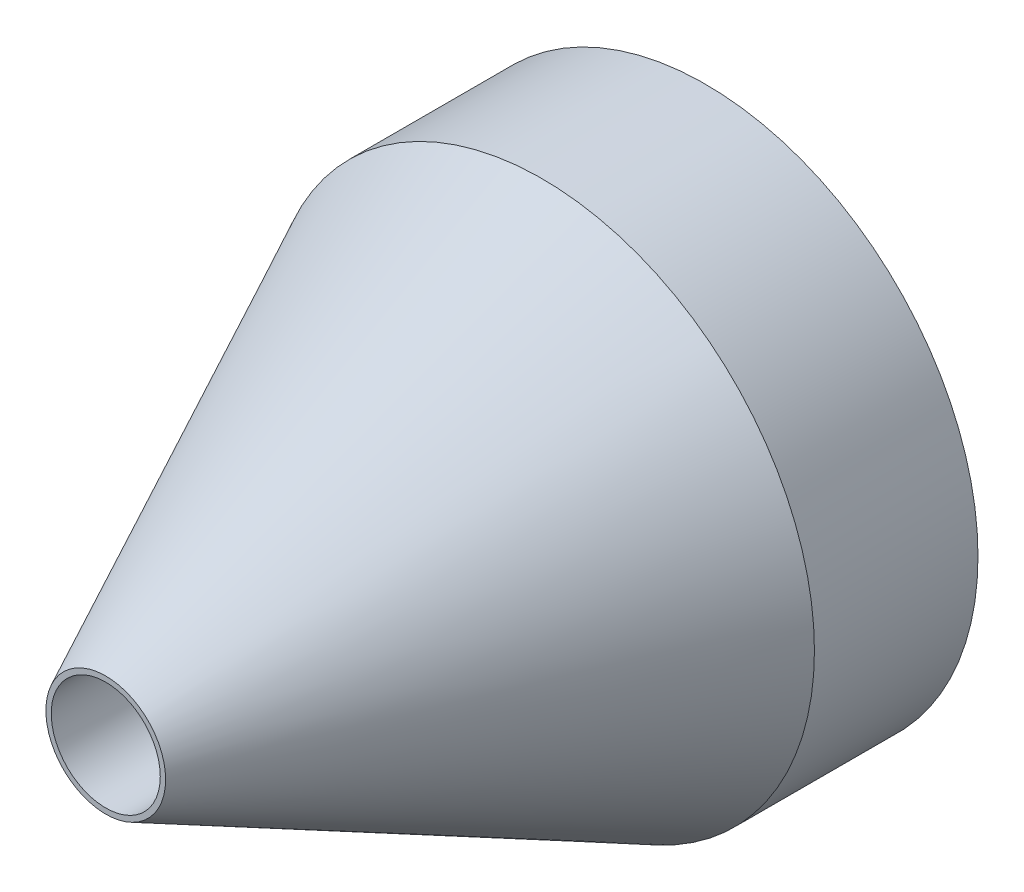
ISO-10303-21;
HEADER;
FILE_DESCRIPTION(('STEP AP214'),'2;1');
FILE_NAME('part.step','',(''),(''),'','','');
FILE_SCHEMA(('AUTOMOTIVE_DESIGN { 1 0 10303 214 1 1 1 1 }'));
ENDSEC;
DATA;
#1=APPLICATION_CONTEXT('core data for automotive mechanical design processes');
#2=APPLICATION_PROTOCOL_DEFINITION('international standard','automotive_design',2000,#1);
#3=PRODUCT_CONTEXT('',#1,'mechanical');
#4=PRODUCT('Part','Part','',(#3));
#5=PRODUCT_RELATED_PRODUCT_CATEGORY('part','',(#4));
#6=PRODUCT_DEFINITION_FORMATION('','',#4);
#7=PRODUCT_DEFINITION_CONTEXT('part definition',#1,'design');
#8=PRODUCT_DEFINITION('design','',#6,#7);
#9=PRODUCT_DEFINITION_SHAPE('','',#8);
#10=(LENGTH_UNIT() NAMED_UNIT(*) SI_UNIT(.MILLI.,.METRE.));
#11=(NAMED_UNIT(*) PLANE_ANGLE_UNIT() SI_UNIT($,.RADIAN.));
#12=(NAMED_UNIT(*) SI_UNIT($,.STERADIAN.) SOLID_ANGLE_UNIT());
#13=UNCERTAINTY_MEASURE_WITH_UNIT(LENGTH_MEASURE(1.E-05),#10,'distance_accuracy_value','');
#14=(GEOMETRIC_REPRESENTATION_CONTEXT(3) GLOBAL_UNCERTAINTY_ASSIGNED_CONTEXT((#13)) GLOBAL_UNIT_ASSIGNED_CONTEXT((#10,
#11,#12)) REPRESENTATION_CONTEXT('',''));
#15=CARTESIAN_POINT('',(0.,0.,0.));
#16=DIRECTION('',(0.,0.,1.));
#17=DIRECTION('',(1.,0.,0.));
#18=AXIS2_PLACEMENT_3D('',#15,#16,#17);
#19=CARTESIAN_POINT('',(0.,0.,15.));
#20=DIRECTION('',(0.,0.,-1.));
#21=DIRECTION('',(-1.,0.,0.));
#22=AXIS2_PLACEMENT_3D('',#19,#20,#21);
#23=CYLINDRICAL_SURFACE('',#22,25.);
#24=CARTESIAN_POINT('',(0.,0.,15.));
#25=DIRECTION('',(0.,0.,1.));
#26=DIRECTION('',(1.,0.,0.));
#27=AXIS2_PLACEMENT_3D('',#24,#25,#26);
#28=CIRCLE('',#27,25.);
#29=CARTESIAN_POINT('',(25.,0.,15.));
#30=VERTEX_POINT('',#29);
#31=EDGE_CURVE('E45',#30,#30,#28,.T.);
#32=ORIENTED_EDGE('',*,*,#31,.F.);
#33=EDGE_LOOP('',(#32));
#34=FACE_BOUND('',#33,.T.);
#35=CARTESIAN_POINT('',(0.,0.,0.));
#36=DIRECTION('',(0.,0.,1.));
#37=DIRECTION('',(1.,0.,0.));
#38=AXIS2_PLACEMENT_3D('',#35,#36,#37);
#39=CIRCLE('',#38,25.);
#40=CARTESIAN_POINT('',(25.,0.,0.));
#41=VERTEX_POINT('',#40);
#42=EDGE_CURVE('E49',#41,#41,#39,.T.);
#43=ORIENTED_EDGE('',*,*,#42,.T.);
#44=EDGE_LOOP('',(#43));
#45=FACE_BOUND('',#44,.T.);
#46=ADVANCED_FACE('F33',(#34,#45),#23,.T.);
#47=CARTESIAN_POINT('',(0.,0.,0.));
#48=DIRECTION('',(0.,0.,1.));
#49=DIRECTION('',(1.,0.,0.));
#50=AXIS2_PLACEMENT_3D('',#47,#48,#49);
#51=PLANE('',#50);
#52=CARTESIAN_POINT('',(0.,0.,0.));
#53=DIRECTION('',(0.,0.,1.));
#54=DIRECTION('',(1.,0.,0.));
#55=AXIS2_PLACEMENT_3D('',#52,#53,#54);
#56=CIRCLE('',#55,21.25);
#57=CARTESIAN_POINT('',(21.25,0.,0.));
#58=VERTEX_POINT('',#57);
#59=EDGE_CURVE('E10',#58,#58,#56,.T.);
#60=ORIENTED_EDGE('',*,*,#59,.T.);
#61=EDGE_LOOP('',(#60));
#62=FACE_BOUND('',#61,.T.);
#63=ORIENTED_EDGE('',*,*,#42,.F.);
#64=EDGE_LOOP('',(#63));
#65=FACE_BOUND('',#64,.T.);
#66=ADVANCED_FACE('F83',(#62,#65),#51,.F.);
#67=CARTESIAN_POINT('',(0.,0.,15.));
#68=DIRECTION('',(0.,0.,-1.));
#69=DIRECTION('',(1.,0.,0.));
#70=AXIS2_PLACEMENT_3D('',#67,#68,#69);
#71=CONICAL_SURFACE('',#70,25.,0.453785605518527);
#72=CARTESIAN_POINT('',(0.,0.,55.));
#73=DIRECTION('',(0.,0.,1.));
#74=DIRECTION('',(1.,0.,0.));
#75=AXIS2_PLACEMENT_3D('',#72,#73,#74);
#76=CIRCLE('',#75,5.4906964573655);
#77=CARTESIAN_POINT('',(5.4906964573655,0.,55.));
#78=VERTEX_POINT('',#77);
#79=EDGE_CURVE('E58',#78,#78,#76,.T.);
#80=CARTESIAN_POINT('',(5.4906964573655,0.,55.));
#81=CARTESIAN_POINT('',(5.69391836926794,0.,54.5833333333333));
#82=CARTESIAN_POINT('',(5.89714028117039,0.,54.1666666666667));
#83=CARTESIAN_POINT('',(6.30358410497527,0.,53.3333333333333));
#84=CARTESIAN_POINT('',(6.50680601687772,0.,52.9166666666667));
#85=CARTESIAN_POINT('',(6.9132498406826,0.,52.0833333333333));
#86=CARTESIAN_POINT('',(7.11647175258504,0.,51.6666666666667));
#87=CARTESIAN_POINT('',(7.52291557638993,0.,50.8333333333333));
#88=CARTESIAN_POINT('',(7.72613748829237,0.,50.4166666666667));
#89=CARTESIAN_POINT('',(8.13258131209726,0.,49.5833333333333));
#90=CARTESIAN_POINT('',(8.3358032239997,0.,49.1666666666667));
#91=CARTESIAN_POINT('',(8.74224704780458,0.,48.3333333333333));
#92=CARTESIAN_POINT('',(8.94546895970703,0.,47.9166666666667));
#93=CARTESIAN_POINT('',(9.35191278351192,0.,47.0833333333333));
#94=CARTESIAN_POINT('',(9.55513469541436,0.,46.6666666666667));
#95=CARTESIAN_POINT('',(9.96157851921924,0.,45.8333333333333));
#96=CARTESIAN_POINT('',(10.1648004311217,0.,45.4166666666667));
#97=CARTESIAN_POINT('',(10.5712442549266,0.,44.5833333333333));
#98=CARTESIAN_POINT('',(10.774466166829,0.,44.1666666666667));
#99=CARTESIAN_POINT('',(11.1809099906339,0.,43.3333333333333));
#100=CARTESIAN_POINT('',(11.3841319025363,0.,42.9166666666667));
#101=CARTESIAN_POINT('',(11.7905757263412,0.,42.0833333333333));
#102=CARTESIAN_POINT('',(11.9937976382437,0.,41.6666666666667));
#103=CARTESIAN_POINT('',(12.4002414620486,0.,40.8333333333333));
#104=CARTESIAN_POINT('',(12.603463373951,0.,40.4166666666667));
#105=CARTESIAN_POINT('',(13.0099071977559,0.,39.5833333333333));
#106=CARTESIAN_POINT('',(13.2131291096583,0.,39.1666666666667));
#107=CARTESIAN_POINT('',(13.6195729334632,0.,38.3333333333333));
#108=CARTESIAN_POINT('',(13.8227948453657,0.,37.9166666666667));
#109=CARTESIAN_POINT('',(14.2292386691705,0.,37.0833333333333));
#110=CARTESIAN_POINT('',(14.432460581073,0.,36.6666666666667));
#111=CARTESIAN_POINT('',(14.8389044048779,0.,35.8333333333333));
#112=CARTESIAN_POINT('',(15.0421263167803,0.,35.4166666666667));
#113=CARTESIAN_POINT('',(15.4485701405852,0.,34.5833333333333));
#114=CARTESIAN_POINT('',(15.6517920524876,0.,34.1666666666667));
#115=CARTESIAN_POINT('',(16.0582358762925,0.,33.3333333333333));
#116=CARTESIAN_POINT('',(16.261457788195,0.,32.9166666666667));
#117=CARTESIAN_POINT('',(16.6679016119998,0.,32.0833333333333));
#118=CARTESIAN_POINT('',(16.8711235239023,0.,31.6666666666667));
#119=CARTESIAN_POINT('',(17.2775673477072,0.,30.8333333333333));
#120=CARTESIAN_POINT('',(17.4807892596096,0.,30.4166666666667));
#121=CARTESIAN_POINT('',(17.8872330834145,0.,29.5833333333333));
#122=CARTESIAN_POINT('',(18.090454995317,0.,29.1666666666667));
#123=CARTESIAN_POINT('',(18.4968988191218,0.,28.3333333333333));
#124=CARTESIAN_POINT('',(18.7001207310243,0.,27.9166666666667));
#125=CARTESIAN_POINT('',(19.1065645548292,0.,27.0833333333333));
#126=CARTESIAN_POINT('',(19.3097864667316,0.,26.6666666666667));
#127=CARTESIAN_POINT('',(19.7162302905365,0.,25.8333333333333));
#128=CARTESIAN_POINT('',(19.9194522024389,0.,25.4166666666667));
#129=CARTESIAN_POINT('',(20.3258960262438,0.,24.5833333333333));
#130=CARTESIAN_POINT('',(20.5291179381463,0.,24.1666666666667));
#131=CARTESIAN_POINT('',(20.9355617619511,0.,23.3333333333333));
#132=CARTESIAN_POINT('',(21.1387836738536,0.,22.9166666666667));
#133=CARTESIAN_POINT('',(21.5452274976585,0.,22.0833333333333));
#134=CARTESIAN_POINT('',(21.7484494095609,0.,21.6666666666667));
#135=CARTESIAN_POINT('',(22.1548932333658,0.,20.8333333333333));
#136=CARTESIAN_POINT('',(22.3581151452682,0.,20.4166666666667));
#137=CARTESIAN_POINT('',(22.7645589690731,0.,19.5833333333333));
#138=CARTESIAN_POINT('',(22.9677808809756,0.,19.1666666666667));
#139=CARTESIAN_POINT('',(23.3742247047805,0.,18.3333333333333));
#140=CARTESIAN_POINT('',(23.5774466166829,0.,17.9166666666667));
#141=CARTESIAN_POINT('',(23.9838904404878,0.,17.0833333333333));
#142=CARTESIAN_POINT('',(24.1871123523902,0.,16.6666666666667));
#143=CARTESIAN_POINT('',(24.5935561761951,0.,15.8333333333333));
#144=CARTESIAN_POINT('',(24.7967780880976,0.,15.4166666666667));
#145=CARTESIAN_POINT('',(25.,0.,15.));
#146=B_SPLINE_CURVE_WITH_KNOTS('',3,(#80,#81,#82,#83,#84,#85,#86,#87,#88,#89,#90,#91,#92,#93,
#94,#95,#96,#97,#98,#99,#100,#101,#102,#103,#104,#105,#106,#107,#108,#109,#110,#111,#112,#113,
#114,#115,#116,#117,#118,#119,#120,#121,#122,#123,#124,#125,#126,#127,#128,#129,#130,#131,#132,
#133,#134,#135,#136,#137,#138,#139,#140,#141,#142,#143,#144,#145),.UNSPECIFIED.,.F.,.F.,(4,2,2,
2,2,2,2,2,2,2,2,2,2,2,2,2,2,2,2,2,2,2,2,2,2,2,2,2,2,2,2,2,4),(0.,1.39075242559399,
2.78150485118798,4.17225727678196,5.56300970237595,6.95376212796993,8.34451455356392,
9.73526697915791,11.1260194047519,12.5167718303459,13.9075242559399,15.2982766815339,
16.6890291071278,18.0797815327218,19.4705339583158,20.8612863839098,22.2520388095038,
23.6427912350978,25.0335436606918,26.4242960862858,27.8150485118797,29.2058009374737,
30.5965533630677,31.9873057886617,33.3780582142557,34.7688106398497,36.1595630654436,
37.5503154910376,38.9410679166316,40.3318203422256,41.7225727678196,43.1133251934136,
44.5040776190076),.UNSPECIFIED.);
#147=EDGE_CURVE('BSEAM77',#78,#30,#146,.T.);
#148=ORIENTED_EDGE('',*,*,#79,.F.);
#149=ORIENTED_EDGE('',*,*,#31,.T.);
#150=ORIENTED_EDGE('',*,*,#147,.T.);
#151=ORIENTED_EDGE('',*,*,#147,.F.);
#152=EDGE_LOOP('',(#148,#150,#149,#151));
#153=FACE_BOUND('',#152,.T.);
#154=ADVANCED_FACE('F77',(#153),#71,.T.);
#155=CARTESIAN_POINT('',(0.,0.,55.));
#156=DIRECTION('',(0.,0.,1.));
#157=DIRECTION('',(1.,0.,0.));
#158=AXIS2_PLACEMENT_3D('',#155,#156,#157);
#159=PLANE('',#158);
#160=CARTESIAN_POINT('',(0.,0.,55.));
#161=DIRECTION('',(0.,0.,1.));
#162=DIRECTION('',(1.,0.,0.));
#163=AXIS2_PLACEMENT_3D('',#160,#161,#162);
#164=CIRCLE('',#163,5.);
#165=CARTESIAN_POINT('',(5.,0.,55.));
#166=VERTEX_POINT('',#165);
#167=EDGE_CURVE('E56',#166,#166,#164,.T.);
#168=ORIENTED_EDGE('',*,*,#167,.F.);
#169=EDGE_LOOP('',(#168));
#170=FACE_BOUND('',#169,.T.);
#171=ORIENTED_EDGE('',*,*,#79,.T.);
#172=EDGE_LOOP('',(#171));
#173=FACE_BOUND('',#172,.T.);
#174=ADVANCED_FACE('F73',(#170,#173),#159,.T.);
#175=CARTESIAN_POINT('',(0.,0.,15.));
#176=DIRECTION('',(0.,0.,-1.));
#177=DIRECTION('',(-1.,0.,0.));
#178=AXIS2_PLACEMENT_3D('',#175,#176,#177);
#179=CYLINDRICAL_SURFACE('',#178,19.75);
#180=CARTESIAN_POINT('',(0.,0.,1.49999999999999));
#181=DIRECTION('',(0.,0.,1.));
#182=DIRECTION('',(1.,0.,0.));
#183=AXIS2_PLACEMENT_3D('',#180,#181,#182);
#184=CIRCLE('',#183,19.75);
#185=CARTESIAN_POINT('',(19.75,0.,1.49999999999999));
#186=VERTEX_POINT('',#185);
#187=EDGE_CURVE('E41',#186,#186,#184,.F.);
#188=ORIENTED_EDGE('',*,*,#187,.T.);
#189=EDGE_LOOP('',(#188));
#190=FACE_BOUND('',#189,.T.);
#191=CARTESIAN_POINT('',(0.,0.,15.));
#192=DIRECTION('',(0.,0.,-1.));
#193=DIRECTION('',(-1.,0.,0.));
#194=AXIS2_PLACEMENT_3D('',#191,#192,#193);
#195=CIRCLE('',#194,19.75);
#196=CARTESIAN_POINT('',(-19.75,0.,15.));
#197=VERTEX_POINT('',#196);
#198=EDGE_CURVE('E62',#197,#197,#195,.F.);
#199=ORIENTED_EDGE('',*,*,#198,.T.);
#200=EDGE_LOOP('',(#199));
#201=FACE_BOUND('',#200,.T.);
#202=ADVANCED_FACE('F76',(#190,#201),#179,.F.);
#203=CARTESIAN_POINT('',(0.,0.,15.));
#204=DIRECTION('',(0.,0.,-1.));
#205=DIRECTION('',(-1.,0.,0.));
#206=AXIS2_PLACEMENT_3D('',#203,#204,#205);
#207=PLANE('',#206);
#208=CARTESIAN_POINT('',(0.,0.,15.));
#209=DIRECTION('',(0.,0.,-1.));
#210=DIRECTION('',(-1.,0.,0.));
#211=AXIS2_PLACEMENT_3D('',#208,#209,#210);
#212=CIRCLE('',#211,20.15);
#213=CARTESIAN_POINT('',(-20.15,0.,15.));
#214=VERTEX_POINT('',#213);
#215=EDGE_CURVE('E55',#214,#214,#212,.T.);
#216=ORIENTED_EDGE('',*,*,#215,.F.);
#217=EDGE_LOOP('',(#216));
#218=FACE_BOUND('',#217,.T.);
#219=ORIENTED_EDGE('',*,*,#198,.F.);
#220=EDGE_LOOP('',(#219));
#221=FACE_BOUND('',#220,.T.);
#222=ADVANCED_FACE('F98',(#218,#221),#207,.F.);
#223=CARTESIAN_POINT('',(0.,0.,15.));
#224=DIRECTION('',(0.,0.,-1.));
#225=DIRECTION('',(-1.,0.,0.));
#226=AXIS2_PLACEMENT_3D('',#223,#224,#225);
#227=CONICAL_SURFACE('',#226,20.15,0.436332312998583);
#228=CARTESIAN_POINT('',(0.,0.,47.4892798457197));
#229=DIRECTION('',(0.,0.,-1.));
#230=DIRECTION('',(-1.,0.,0.));
#231=AXIS2_PLACEMENT_3D('',#228,#229,#230);
#232=CIRCLE('',#231,5.);
#233=CARTESIAN_POINT('',(-5.,0.,47.4892798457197));
#234=VERTEX_POINT('',#233);
#235=EDGE_CURVE('E52',#234,#234,#232,.F.);
#236=CARTESIAN_POINT('',(-5.,0.,47.4892798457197));
#237=CARTESIAN_POINT('',(-5.15781249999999,0.,47.1508498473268));
#238=CARTESIAN_POINT('',(-5.31562499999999,0.,46.8124198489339));
#239=CARTESIAN_POINT('',(-5.63125,0.,46.1355598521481));
#240=CARTESIAN_POINT('',(-5.7890625,0.,45.7971298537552));
#241=CARTESIAN_POINT('',(-6.1046875,0.,45.1202698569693));
#242=CARTESIAN_POINT('',(-6.2625,0.,44.7818398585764));
#243=CARTESIAN_POINT('',(-6.57812499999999,0.,44.1049798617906));
#244=CARTESIAN_POINT('',(-6.7359375,0.,43.7665498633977));
#245=CARTESIAN_POINT('',(-7.0515625,0.,43.0896898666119));
#246=CARTESIAN_POINT('',(-7.209375,0.,42.7512598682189));
#247=CARTESIAN_POINT('',(-7.525,0.,42.0743998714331));
#248=CARTESIAN_POINT('',(-7.6828125,0.,41.7359698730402));
#249=CARTESIAN_POINT('',(-7.9984375,0.,41.0591098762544));
#250=CARTESIAN_POINT('',(-8.15624999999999,0.,40.7206798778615));
#251=CARTESIAN_POINT('',(-8.471875,0.,40.0438198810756));
#252=CARTESIAN_POINT('',(-8.6296875,0.,39.7053898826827));
#253=CARTESIAN_POINT('',(-8.9453125,0.,39.0285298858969));
#254=CARTESIAN_POINT('',(-9.103125,0.,38.690099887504));
#255=CARTESIAN_POINT('',(-9.41875,0.,38.0132398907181));
#256=CARTESIAN_POINT('',(-9.5765625,0.,37.6748098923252));
#257=CARTESIAN_POINT('',(-9.8921875,0.,36.9979498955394));
#258=CARTESIAN_POINT('',(-10.05,0.,36.6595198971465));
#259=CARTESIAN_POINT('',(-10.365625,0.,35.9826599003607));
#260=CARTESIAN_POINT('',(-10.5234375,0.,35.6442299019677));
#261=CARTESIAN_POINT('',(-10.8390625,0.,34.9673699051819));
#262=CARTESIAN_POINT('',(-10.996875,0.,34.628939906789));
#263=CARTESIAN_POINT('',(-11.3125,0.,33.9520799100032));
#264=CARTESIAN_POINT('',(-11.4703125,0.,33.6136499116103));
#265=CARTESIAN_POINT('',(-11.7859375,0.,32.9367899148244));
#266=CARTESIAN_POINT('',(-11.94375,0.,32.5983599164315));
#267=CARTESIAN_POINT('',(-12.259375,0.,31.9214999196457));
#268=CARTESIAN_POINT('',(-12.4171875,0.,31.5830699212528));
#269=CARTESIAN_POINT('',(-12.7328125,0.,30.906209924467));
#270=CARTESIAN_POINT('',(-12.890625,0.,30.567779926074));
#271=CARTESIAN_POINT('',(-13.20625,0.,29.8909199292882));
#272=CARTESIAN_POINT('',(-13.3640625,0.,29.5524899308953));
#273=CARTESIAN_POINT('',(-13.6796875,0.,28.8756299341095));
#274=CARTESIAN_POINT('',(-13.8375,0.,28.5371999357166));
#275=CARTESIAN_POINT('',(-14.153125,0.,27.8603399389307));
#276=CARTESIAN_POINT('',(-14.3109375,0.,27.5219099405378));
#277=CARTESIAN_POINT('',(-14.6265625,0.,26.845049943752));
#278=CARTESIAN_POINT('',(-14.784375,0.,26.5066199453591));
#279=CARTESIAN_POINT('',(-15.1,0.,25.8297599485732));
#280=CARTESIAN_POINT('',(-15.2578125,0.,25.4913299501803));
#281=CARTESIAN_POINT('',(-15.5734375,0.,24.8144699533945));
#282=CARTESIAN_POINT('',(-15.73125,0.,24.4760399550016));
#283=CARTESIAN_POINT('',(-16.046875,0.,23.7991799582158));
#284=CARTESIAN_POINT('',(-16.2046875,0.,23.4607499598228));
#285=CARTESIAN_POINT('',(-16.5203125,0.,22.783889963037));
#286=CARTESIAN_POINT('',(-16.678125,0.,22.4454599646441));
#287=CARTESIAN_POINT('',(-16.99375,0.,21.7685999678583));
#288=CARTESIAN_POINT('',(-17.1515625,0.,21.4301699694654));
#289=CARTESIAN_POINT('',(-17.4671875,0.,20.7533099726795));
#290=CARTESIAN_POINT('',(-17.625,0.,20.4148799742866));
#291=CARTESIAN_POINT('',(-17.940625,0.,19.7380199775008));
#292=CARTESIAN_POINT('',(-18.0984375,0.,19.3995899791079));
#293=CARTESIAN_POINT('',(-18.4140625,0.,18.7227299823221));
#294=CARTESIAN_POINT('',(-18.571875,0.,18.3842999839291));
#295=CARTESIAN_POINT('',(-18.8875,0.,17.7074399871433));
#296=CARTESIAN_POINT('',(-19.0453125,0.,17.3690099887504));
#297=CARTESIAN_POINT('',(-19.3609375,0.,16.6921499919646));
#298=CARTESIAN_POINT('',(-19.51875,0.,16.3537199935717));
#299=CARTESIAN_POINT('',(-19.834375,0.,15.6768599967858));
#300=CARTESIAN_POINT('',(-19.9921875,0.,15.3384299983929));
#301=CARTESIAN_POINT('',(-20.15,0.,15.));
#302=B_SPLINE_CURVE_WITH_KNOTS('',3,(#236,#237,#238,#239,#240,#241,#242,#243,#244,#245,#246,
#247,#248,#249,#250,#251,#252,#253,#254,#255,#256,#257,#258,#259,#260,#261,#262,#263,#264,#265,
#266,#267,#268,#269,#270,#271,#272,#273,#274,#275,#276,#277,#278,#279,#280,#281,#282,#283,#284,
#285,#286,#287,#288,#289,#290,#291,#292,#293,#294,#295,#296,#297,#298,#299,#300,#301),
.UNSPECIFIED.,.F.,.F.,(4,2,2,2,2,2,2,2,2,2,2,2,2,2,2,2,2,2,2,2,2,2,2,2,2,2,2,2,2,2,2,2,4),(0.,
1.12024856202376,2.24049712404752,3.36074568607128,4.48099424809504,5.6012428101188,
6.72149137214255,7.84173993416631,8.96198849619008,10.0822370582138,11.2024856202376,
12.3227341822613,13.4429827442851,14.5632313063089,15.6834798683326,16.8037284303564,
17.9239769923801,19.0442255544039,20.1644741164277,21.2847226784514,22.4049712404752,
23.5252198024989,24.6454683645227,25.7657169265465,26.8859654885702,28.006214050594,
29.1264626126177,30.2467111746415,31.3669597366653,32.487208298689,33.6074568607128,
34.7277054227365,35.8479539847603),.UNSPECIFIED.);
#303=EDGE_CURVE('BSEAM99',#234,#214,#302,.T.);
#304=ORIENTED_EDGE('',*,*,#235,.T.);
#305=ORIENTED_EDGE('',*,*,#215,.T.);
#306=ORIENTED_EDGE('',*,*,#303,.T.);
#307=ORIENTED_EDGE('',*,*,#303,.F.);
#308=EDGE_LOOP('',(#304,#306,#305,#307));
#309=FACE_BOUND('',#308,.T.);
#310=ADVANCED_FACE('F99',(#309),#227,.F.);
#311=CARTESIAN_POINT('',(0.,0.,9.99999999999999));
#312=DIRECTION('',(0.,0.,1.));
#313=DIRECTION('',(1.,0.,0.));
#314=AXIS2_PLACEMENT_3D('',#311,#312,#313);
#315=CYLINDRICAL_SURFACE('',#314,5.);
#316=ORIENTED_EDGE('',*,*,#167,.T.);
#317=EDGE_LOOP('',(#316));
#318=FACE_BOUND('',#317,.T.);
#319=ORIENTED_EDGE('',*,*,#235,.F.);
#320=EDGE_LOOP('',(#319));
#321=FACE_BOUND('',#320,.T.);
#322=ADVANCED_FACE('F70',(#318,#321),#315,.F.);
#323=CARTESIAN_POINT('',(0.,0.,1.49999999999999));
#324=DIRECTION('',(0.,0.,-1.));
#325=DIRECTION('',(-1.,0.,0.));
#326=AXIS2_PLACEMENT_3D('',#323,#324,#325);
#327=CONICAL_SURFACE('',#326,19.75,0.785398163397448);
#328=ORIENTED_EDGE('',*,*,#59,.F.);
#329=EDGE_LOOP('',(#328));
#330=FACE_BOUND('',#329,.T.);
#331=ORIENTED_EDGE('',*,*,#187,.F.);
#332=EDGE_LOOP('',(#331));
#333=FACE_BOUND('',#332,.T.);
#334=ADVANCED_FACE('F36',(#330,#333),#327,.F.);
#335=CLOSED_SHELL('',(#46,#66,#154,#174,#202,#222,#310,#322,#334));
#336=MANIFOLD_SOLID_BREP('B2',#335);
#337=ADVANCED_BREP_SHAPE_REPRESENTATION('',(#18,#336),#14);
#338=SHAPE_DEFINITION_REPRESENTATION(#9,#337);
ENDSEC;
END-ISO-10303-21;
